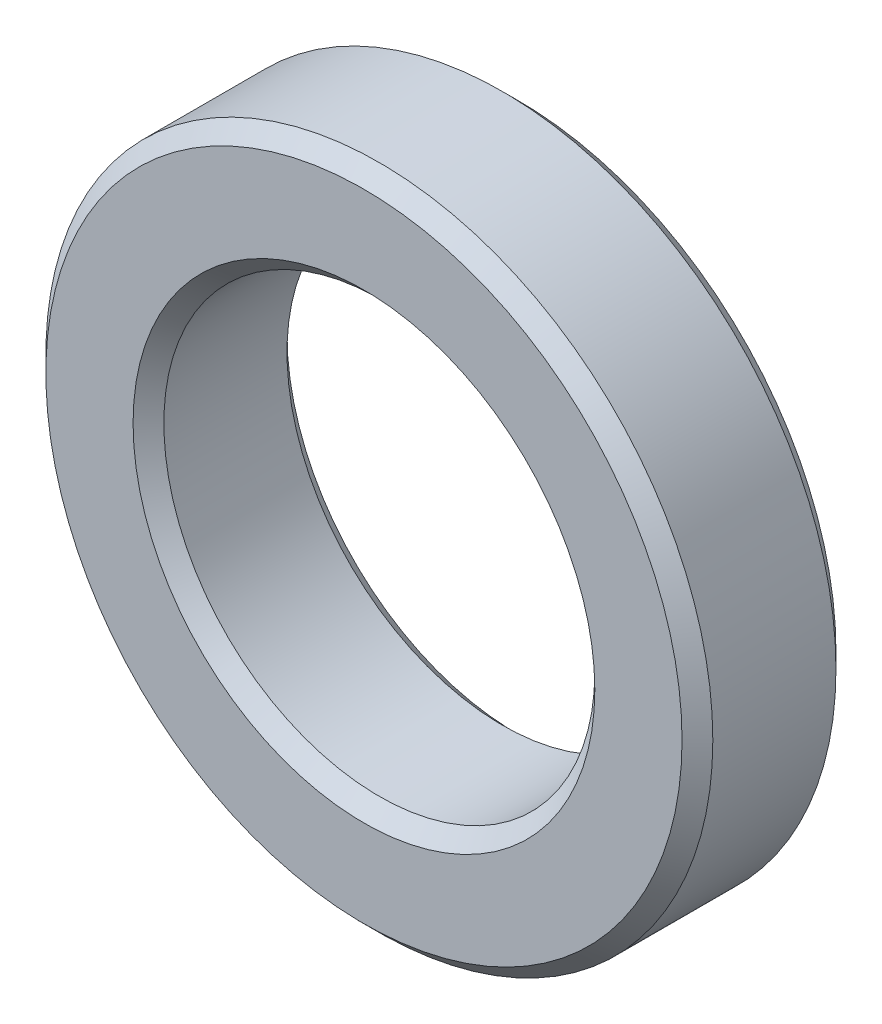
ISO-10303-21;
HEADER;
FILE_DESCRIPTION(('STEP AP214'),'2;1');
FILE_NAME('part.step','',(''),(''),'','','');
FILE_SCHEMA(('AUTOMOTIVE_DESIGN { 1 0 10303 214 1 1 1 1 }'));
ENDSEC;
DATA;
#1=APPLICATION_CONTEXT('core data for automotive mechanical design processes');
#2=APPLICATION_PROTOCOL_DEFINITION('international standard','automotive_design',2000,#1);
#3=PRODUCT_CONTEXT('',#1,'mechanical');
#4=PRODUCT('Part','Part','',(#3));
#5=PRODUCT_RELATED_PRODUCT_CATEGORY('part','',(#4));
#6=PRODUCT_DEFINITION_FORMATION('','',#4);
#7=PRODUCT_DEFINITION_CONTEXT('part definition',#1,'design');
#8=PRODUCT_DEFINITION('design','',#6,#7);
#9=PRODUCT_DEFINITION_SHAPE('','',#8);
#10=(LENGTH_UNIT() NAMED_UNIT(*) SI_UNIT(.MILLI.,.METRE.));
#11=(NAMED_UNIT(*) PLANE_ANGLE_UNIT() SI_UNIT($,.RADIAN.));
#12=(NAMED_UNIT(*) SI_UNIT($,.STERADIAN.) SOLID_ANGLE_UNIT());
#13=UNCERTAINTY_MEASURE_WITH_UNIT(LENGTH_MEASURE(1.E-05),#10,'distance_accuracy_value','');
#14=(GEOMETRIC_REPRESENTATION_CONTEXT(3) GLOBAL_UNCERTAINTY_ASSIGNED_CONTEXT((#13)) GLOBAL_UNIT_ASSIGNED_CONTEXT((#10,
#11,#12)) REPRESENTATION_CONTEXT('',''));
#15=CARTESIAN_POINT('',(0.,0.,0.));
#16=DIRECTION('',(0.,0.,1.));
#17=DIRECTION('',(1.,0.,0.));
#18=AXIS2_PLACEMENT_3D('',#15,#16,#17);
#19=CARTESIAN_POINT('',(0.,0.,3.));
#20=DIRECTION('',(0.,0.,1.));
#21=DIRECTION('',(1.,0.,0.));
#22=AXIS2_PLACEMENT_3D('',#19,#20,#21);
#23=PLANE('',#22);
#24=CARTESIAN_POINT('',(0.,0.,3.));
#25=DIRECTION('',(0.,0.,1.));
#26=DIRECTION('',(1.,0.,0.));
#27=AXIS2_PLACEMENT_3D('',#24,#25,#26);
#28=CIRCLE('',#27,4.5);
#29=CARTESIAN_POINT('',(4.5,0.,3.));
#30=VERTEX_POINT('',#29);
#31=EDGE_CURVE('E8',#30,#30,#28,.F.);
#32=ORIENTED_EDGE('',*,*,#31,.T.);
#33=EDGE_LOOP('',(#32));
#34=FACE_BOUND('',#33,.T.);
#35=CARTESIAN_POINT('',(0.,0.,3.));
#36=DIRECTION('',(0.,0.,1.));
#37=DIRECTION('',(1.,0.,0.));
#38=AXIS2_PLACEMENT_3D('',#35,#36,#37);
#39=CIRCLE('',#38,6.2);
#40=CARTESIAN_POINT('',(6.2,0.,3.));
#41=VERTEX_POINT('',#40);
#42=EDGE_CURVE('E19',#41,#41,#39,.T.);
#43=ORIENTED_EDGE('',*,*,#42,.T.);
#44=EDGE_LOOP('',(#43));
#45=FACE_BOUND('',#44,.T.);
#46=ADVANCED_FACE('F12',(#34,#45),#23,.T.);
#47=CARTESIAN_POINT('',(0.,0.,0.));
#48=DIRECTION('',(0.,0.,1.));
#49=DIRECTION('',(1.,0.,0.));
#50=AXIS2_PLACEMENT_3D('',#47,#48,#49);
#51=PLANE('',#50);
#52=CARTESIAN_POINT('',(0.,0.,0.));
#53=DIRECTION('',(0.,0.,1.));
#54=DIRECTION('',(1.,0.,0.));
#55=AXIS2_PLACEMENT_3D('',#52,#53,#54);
#56=CIRCLE('',#55,6.2);
#57=CARTESIAN_POINT('',(6.2,0.,0.));
#58=VERTEX_POINT('',#57);
#59=EDGE_CURVE('E32',#58,#58,#56,.F.);
#60=ORIENTED_EDGE('',*,*,#59,.T.);
#61=EDGE_LOOP('',(#60));
#62=FACE_BOUND('',#61,.T.);
#63=CARTESIAN_POINT('',(0.,0.,0.));
#64=DIRECTION('',(0.,0.,1.));
#65=DIRECTION('',(1.,0.,0.));
#66=AXIS2_PLACEMENT_3D('',#63,#64,#65);
#67=CIRCLE('',#66,4.5);
#68=CARTESIAN_POINT('',(4.5,0.,0.));
#69=VERTEX_POINT('',#68);
#70=EDGE_CURVE('E35',#69,#69,#67,.T.);
#71=ORIENTED_EDGE('',*,*,#70,.T.);
#72=EDGE_LOOP('',(#71));
#73=FACE_BOUND('',#72,.T.);
#74=ADVANCED_FACE('F58',(#62,#73),#51,.F.);
#75=CARTESIAN_POINT('',(0.,0.,3.));
#76=DIRECTION('',(0.,0.,-1.));
#77=DIRECTION('',(-1.,0.,0.));
#78=AXIS2_PLACEMENT_3D('',#75,#76,#77);
#79=CYLINDRICAL_SURFACE('',#78,6.5);
#80=CARTESIAN_POINT('',(0.,0.,0.300000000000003));
#81=DIRECTION('',(0.,0.,1.));
#82=DIRECTION('',(1.,0.,0.));
#83=AXIS2_PLACEMENT_3D('',#80,#81,#82);
#84=CIRCLE('',#83,6.5);
#85=CARTESIAN_POINT('',(6.5,0.,0.300000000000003));
#86=VERTEX_POINT('',#85);
#87=EDGE_CURVE('E38',#86,#86,#84,.T.);
#88=ORIENTED_EDGE('',*,*,#87,.T.);
#89=EDGE_LOOP('',(#88));
#90=FACE_BOUND('',#89,.T.);
#91=CARTESIAN_POINT('',(0.,0.,2.7));
#92=DIRECTION('',(0.,0.,1.));
#93=DIRECTION('',(1.,0.,0.));
#94=AXIS2_PLACEMENT_3D('',#91,#92,#93);
#95=CIRCLE('',#94,6.5);
#96=CARTESIAN_POINT('',(6.5,0.,2.7));
#97=VERTEX_POINT('',#96);
#98=EDGE_CURVE('E41',#97,#97,#95,.F.);
#99=ORIENTED_EDGE('',*,*,#98,.T.);
#100=EDGE_LOOP('',(#99));
#101=FACE_BOUND('',#100,.T.);
#102=ADVANCED_FACE('F45',(#90,#101),#79,.T.);
#103=CARTESIAN_POINT('',(0.,0.,3.));
#104=DIRECTION('',(0.,0.,-1.));
#105=DIRECTION('',(-1.,0.,0.));
#106=AXIS2_PLACEMENT_3D('',#103,#104,#105);
#107=CYLINDRICAL_SURFACE('',#106,4.2);
#108=CARTESIAN_POINT('',(0.,0.,0.300000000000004));
#109=DIRECTION('',(0.,0.,1.));
#110=DIRECTION('',(1.,0.,0.));
#111=AXIS2_PLACEMENT_3D('',#108,#109,#110);
#112=CIRCLE('',#111,4.2);
#113=CARTESIAN_POINT('',(4.2,0.,0.300000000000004));
#114=VERTEX_POINT('',#113);
#115=EDGE_CURVE('E23',#114,#114,#112,.F.);
#116=ORIENTED_EDGE('',*,*,#115,.T.);
#117=EDGE_LOOP('',(#116));
#118=FACE_BOUND('',#117,.T.);
#119=CARTESIAN_POINT('',(0.,0.,2.7));
#120=DIRECTION('',(0.,0.,1.));
#121=DIRECTION('',(1.,0.,0.));
#122=AXIS2_PLACEMENT_3D('',#119,#120,#121);
#123=CIRCLE('',#122,4.2);
#124=CARTESIAN_POINT('',(4.2,0.,2.7));
#125=VERTEX_POINT('',#124);
#126=EDGE_CURVE('E27',#125,#125,#123,.T.);
#127=ORIENTED_EDGE('',*,*,#126,.T.);
#128=EDGE_LOOP('',(#127));
#129=FACE_BOUND('',#128,.T.);
#130=ADVANCED_FACE('F70',(#118,#129),#107,.F.);
#131=CARTESIAN_POINT('',(0.,0.,0.300000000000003));
#132=DIRECTION('',(0.,0.,1.));
#133=DIRECTION('',(1.,0.,0.));
#134=AXIS2_PLACEMENT_3D('',#131,#132,#133);
#135=CONICAL_SURFACE('',#134,6.5,0.785398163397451);
#136=ORIENTED_EDGE('',*,*,#59,.F.);
#137=EDGE_LOOP('',(#136));
#138=FACE_BOUND('',#137,.T.);
#139=ORIENTED_EDGE('',*,*,#87,.F.);
#140=EDGE_LOOP('',(#139));
#141=FACE_BOUND('',#140,.T.);
#142=ADVANCED_FACE('F72',(#138,#141),#135,.T.);
#143=CARTESIAN_POINT('',(0.,0.,0.));
#144=DIRECTION('',(0.,0.,-1.));
#145=DIRECTION('',(-1.,0.,0.));
#146=AXIS2_PLACEMENT_3D('',#143,#144,#145);
#147=CONICAL_SURFACE('',#146,4.5,0.785398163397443);
#148=ORIENTED_EDGE('',*,*,#115,.F.);
#149=EDGE_LOOP('',(#148));
#150=FACE_BOUND('',#149,.T.);
#151=ORIENTED_EDGE('',*,*,#70,.F.);
#152=EDGE_LOOP('',(#151));
#153=FACE_BOUND('',#152,.T.);
#154=ADVANCED_FACE('F55',(#150,#153),#147,.F.);
#155=CARTESIAN_POINT('',(0.,0.,2.7));
#156=DIRECTION('',(0.,0.,1.));
#157=DIRECTION('',(1.,0.,0.));
#158=AXIS2_PLACEMENT_3D('',#155,#156,#157);
#159=CONICAL_SURFACE('',#158,4.2,0.785398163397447);
#160=ORIENTED_EDGE('',*,*,#31,.F.);
#161=EDGE_LOOP('',(#160));
#162=FACE_BOUND('',#161,.T.);
#163=ORIENTED_EDGE('',*,*,#126,.F.);
#164=EDGE_LOOP('',(#163));
#165=FACE_BOUND('',#164,.T.);
#166=ADVANCED_FACE('F49',(#162,#165),#159,.F.);
#167=CARTESIAN_POINT('',(0.,0.,3.));
#168=DIRECTION('',(0.,0.,-1.));
#169=DIRECTION('',(-1.,0.,0.));
#170=AXIS2_PLACEMENT_3D('',#167,#168,#169);
#171=CONICAL_SURFACE('',#170,6.2,0.785398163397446);
#172=ORIENTED_EDGE('',*,*,#98,.F.);
#173=EDGE_LOOP('',(#172));
#174=FACE_BOUND('',#173,.T.);
#175=ORIENTED_EDGE('',*,*,#42,.F.);
#176=EDGE_LOOP('',(#175));
#177=FACE_BOUND('',#176,.T.);
#178=ADVANCED_FACE('F14',(#174,#177),#171,.T.);
#179=CLOSED_SHELL('',(#46,#74,#102,#130,#142,#154,#166,#178));
#180=MANIFOLD_SOLID_BREP('B1',#179);
#181=ADVANCED_BREP_SHAPE_REPRESENTATION('',(#18,#180),#14);
#182=SHAPE_DEFINITION_REPRESENTATION(#9,#181);
ENDSEC;
END-ISO-10303-21;
